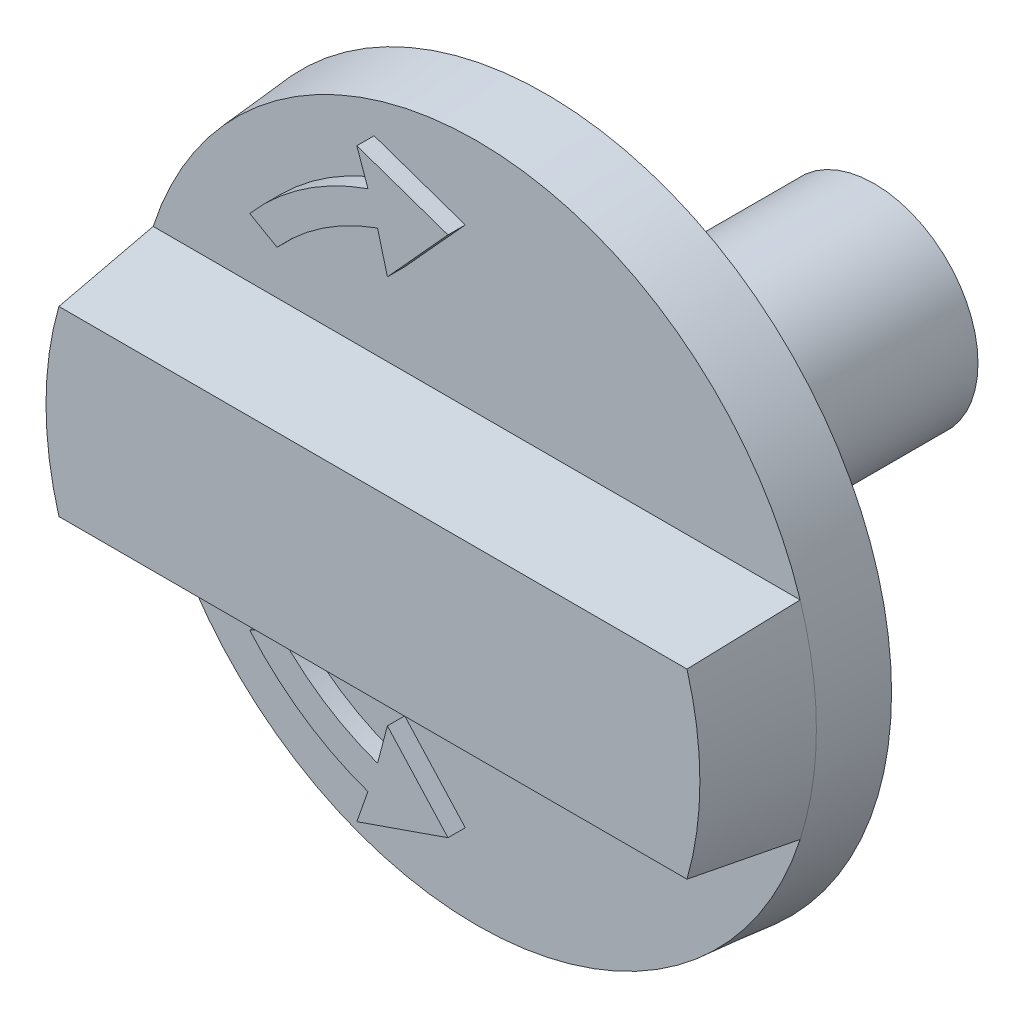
ISO-10303-21;
HEADER;
FILE_DESCRIPTION(('STEP AP214'),'2;1');
FILE_NAME('part.step','',(''),(''),'','','');
FILE_SCHEMA(('AUTOMOTIVE_DESIGN { 1 0 10303 214 1 1 1 1 }'));
ENDSEC;
DATA;
#1=APPLICATION_CONTEXT('core data for automotive mechanical design processes');
#2=APPLICATION_PROTOCOL_DEFINITION('international standard','automotive_design',2000,#1);
#3=PRODUCT_CONTEXT('',#1,'mechanical');
#4=PRODUCT('Part','Part','',(#3));
#5=PRODUCT_RELATED_PRODUCT_CATEGORY('part','',(#4));
#6=PRODUCT_DEFINITION_FORMATION('','',#4);
#7=PRODUCT_DEFINITION_CONTEXT('part definition',#1,'design');
#8=PRODUCT_DEFINITION('design','',#6,#7);
#9=PRODUCT_DEFINITION_SHAPE('','',#8);
#10=(LENGTH_UNIT() NAMED_UNIT(*) SI_UNIT(.MILLI.,.METRE.));
#11=(NAMED_UNIT(*) PLANE_ANGLE_UNIT() SI_UNIT($,.RADIAN.));
#12=(NAMED_UNIT(*) SI_UNIT($,.STERADIAN.) SOLID_ANGLE_UNIT());
#13=UNCERTAINTY_MEASURE_WITH_UNIT(LENGTH_MEASURE(1.E-05),#10,'distance_accuracy_value','');
#14=(GEOMETRIC_REPRESENTATION_CONTEXT(3) GLOBAL_UNCERTAINTY_ASSIGNED_CONTEXT((#13)) GLOBAL_UNIT_ASSIGNED_CONTEXT((#10,
#11,#12)) REPRESENTATION_CONTEXT('',''));
#15=CARTESIAN_POINT('',(0.,0.,0.));
#16=DIRECTION('',(0.,0.,1.));
#17=DIRECTION('',(1.,0.,0.));
#18=AXIS2_PLACEMENT_3D('',#15,#16,#17);
#19=CARTESIAN_POINT('',(0.,0.,0.));
#20=DIRECTION('',(0.,0.,1.));
#21=DIRECTION('',(1.,0.,0.));
#22=AXIS2_PLACEMENT_3D('',#19,#20,#21);
#23=PLANE('',#22);
#24=CARTESIAN_POINT('',(0.,0.,0.));
#25=DIRECTION('',(0.,0.,1.));
#26=DIRECTION('',(1.,0.,0.));
#27=AXIS2_PLACEMENT_3D('',#24,#25,#26);
#28=CIRCLE('',#27,10.);
#29=CARTESIAN_POINT('',(10.,0.,0.));
#30=VERTEX_POINT('',#29);
#31=EDGE_CURVE('E361',#30,#30,#28,.T.);
#32=ORIENTED_EDGE('',*,*,#31,.F.);
#33=EDGE_LOOP('',(#32));
#34=FACE_BOUND('',#33,.T.);
#35=CARTESIAN_POINT('',(0.,0.,0.));
#36=DIRECTION('',(0.,0.,1.));
#37=DIRECTION('',(1.,0.,0.));
#38=AXIS2_PLACEMENT_3D('',#35,#36,#37);
#39=CIRCLE('',#38,3.);
#40=CARTESIAN_POINT('',(3.,0.,0.));
#41=VERTEX_POINT('',#40);
#42=EDGE_CURVE('E11',#41,#41,#39,.F.);
#43=ORIENTED_EDGE('',*,*,#42,.F.);
#44=EDGE_LOOP('',(#43));
#45=FACE_BOUND('',#44,.T.);
#46=ADVANCED_FACE('F24',(#34,#45),#23,.F.);
#47=CARTESIAN_POINT('',(0.,0.,2.));
#48=DIRECTION('',(0.,0.,1.));
#49=DIRECTION('',(1.,0.,0.));
#50=AXIS2_PLACEMENT_3D('',#47,#48,#49);
#51=PLANE('',#50);
#52=DIRECTION('',(-1.,0.,0.));
#53=VECTOR('',#52,1.);
#54=CARTESIAN_POINT('',(-9.35580410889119,3.,2.));
#55=LINE('',#54,#53);
#56=CARTESIAN_POINT('',(9.35580410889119,3.,2.));
#57=VERTEX_POINT('',#56);
#58=CARTESIAN_POINT('',(-9.35580410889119,3.,2.));
#59=VERTEX_POINT('',#58);
#60=EDGE_CURVE('E308',#57,#59,#55,.T.);
#61=ORIENTED_EDGE('',*,*,#60,.F.);
#62=CARTESIAN_POINT('',(0.,0.,2.));
#63=DIRECTION('',(0.,0.,1.));
#64=DIRECTION('',(1.,0.,0.));
#65=AXIS2_PLACEMENT_3D('',#62,#63,#64);
#66=CIRCLE('',#65,9.82502267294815);
#67=EDGE_CURVE('E32',#57,#59,#66,.T.);
#68=ORIENTED_EDGE('',*,*,#67,.T.);
#69=EDGE_LOOP('',(#61,#68));
#70=FACE_BOUND('',#69,.T.);
#71=DIRECTION('',(0.867432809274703,-0.497554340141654,0.));
#72=VECTOR('',#71,1.);
#73=CARTESIAN_POINT('',(-6.06240197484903,5.2198929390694,2.));
#74=LINE('',#73,#72);
#75=CARTESIAN_POINT('',(-6.06240197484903,5.2198929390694,2.));
#76=VERTEX_POINT('',#75);
#77=CARTESIAN_POINT('',(-5.27297973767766,4.76708500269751,2.));
#78=VERTEX_POINT('',#77);
#79=EDGE_CURVE('E209',#76,#78,#74,.T.);
#80=ORIENTED_EDGE('',*,*,#79,.F.);
#81=CARTESIAN_POINT('',(0.,0.,2.));
#82=DIRECTION('',(0.,0.,1.));
#83=DIRECTION('',(-1.,0.,0.));
#84=AXIS2_PLACEMENT_3D('',#81,#82,#83);
#85=CIRCLE('',#84,8.);
#86=CARTESIAN_POINT('',(-2.64538356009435,7.54996329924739,2.));
#87=VERTEX_POINT('',#86);
#88=EDGE_CURVE('E206',#87,#76,#85,.T.);
#89=ORIENTED_EDGE('',*,*,#88,.F.);
#90=DIRECTION('',(0.330672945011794,-0.943745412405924,0.));
#91=VECTOR('',#90,1.);
#92=CARTESIAN_POINT('',(-2.64538356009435,7.54996329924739,2.));
#93=LINE('',#92,#91);
#94=CARTESIAN_POINT('',(-2.9662693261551,8.4657759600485,2.));
#95=VERTEX_POINT('',#94);
#96=EDGE_CURVE('E220',#95,#87,#93,.T.);
#97=ORIENTED_EDGE('',*,*,#96,.F.);
#98=DIRECTION('',(-0.944594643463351,0.328239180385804,0.));
#99=VECTOR('',#98,1.);
#100=CARTESIAN_POINT('',(-2.9662693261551,8.4657759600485,2.));
#101=LINE('',#100,#99);
#102=CARTESIAN_POINT('',(-0.330777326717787,7.54996329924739,2.));
#103=VERTEX_POINT('',#102);
#104=EDGE_CURVE('E217',#103,#95,#101,.T.);
#105=ORIENTED_EDGE('',*,*,#104,.F.);
#106=DIRECTION('',(0.672585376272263,0.740019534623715,0.));
#107=VECTOR('',#106,1.);
#108=CARTESIAN_POINT('',(-0.330777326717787,7.54996329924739,2.));
#109=LINE('',#108,#107);
#110=CARTESIAN_POINT('',(-2.08195140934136,5.62321455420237,2.));
#111=VERTEX_POINT('',#110);
#112=EDGE_CURVE('E215',#111,#103,#109,.T.);
#113=ORIENTED_EDGE('',*,*,#112,.F.);
#114=DIRECTION('',(0.255171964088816,-0.966895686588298,0.));
#115=VECTOR('',#114,1.);
#116=CARTESIAN_POINT('',(-2.08195140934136,5.62321455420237,2.));
#117=LINE('',#116,#115);
#118=CARTESIAN_POINT('',(-2.36686037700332,6.7027894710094,2.));
#119=VERTEX_POINT('',#118);
#120=EDGE_CURVE('E213',#119,#111,#117,.T.);
#121=ORIENTED_EDGE('',*,*,#120,.F.);
#122=CARTESIAN_POINT('',(0.,0.,2.));
#123=DIRECTION('',(0.,0.,-1.));
#124=DIRECTION('',(-1.,0.,0.));
#125=AXIS2_PLACEMENT_3D('',#122,#123,#124);
#126=CIRCLE('',#125,7.10840451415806);
#127=EDGE_CURVE('E211',#78,#119,#126,.T.);
#128=ORIENTED_EDGE('',*,*,#127,.F.);
#129=EDGE_LOOP('',(#80,#89,#97,#105,#113,#121,#128));
#130=FACE_BOUND('',#129,.T.);
#131=ADVANCED_FACE('F338',(#70,#130),#51,.T.);
#132=CARTESIAN_POINT('',(0.,0.,0.));
#133=DIRECTION('',(0.,0.,-1.));
#134=DIRECTION('',(1.,0.,0.));
#135=AXIS2_PLACEMENT_3D('',#132,#133,#134);
#136=CONICAL_SURFACE('',#135,10.,0.0872664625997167);
#137=ORIENTED_EDGE('',*,*,#67,.F.);
#138=CARTESIAN_POINT('',(0.,0.,2.));
#139=DIRECTION('',(0.,0.,1.));
#140=DIRECTION('',(1.,0.,0.));
#141=AXIS2_PLACEMENT_3D('',#138,#139,#140);
#142=CIRCLE('',#141,9.82502267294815);
#143=CARTESIAN_POINT('',(9.35580410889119,-3.,2.));
#144=VERTEX_POINT('',#143);
#145=EDGE_CURVE('E266',#144,#57,#142,.T.);
#146=ORIENTED_EDGE('',*,*,#145,.F.);
#147=CARTESIAN_POINT('',(-9.35580410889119,-3.,2.));
#148=VERTEX_POINT('',#147);
#149=EDGE_CURVE('E267',#148,#144,#66,.T.);
#150=ORIENTED_EDGE('',*,*,#149,.F.);
#151=CARTESIAN_POINT('',(0.,0.,2.));
#152=DIRECTION('',(0.,0.,1.));
#153=DIRECTION('',(1.,0.,0.));
#154=AXIS2_PLACEMENT_3D('',#151,#152,#153);
#155=CIRCLE('',#154,9.82502267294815);
#156=EDGE_CURVE('E256',#59,#148,#155,.T.);
#157=ORIENTED_EDGE('',*,*,#156,.F.);
#158=EDGE_LOOP('',(#137,#146,#150,#157));
#159=FACE_BOUND('',#158,.T.);
#160=ORIENTED_EDGE('',*,*,#31,.T.);
#161=EDGE_LOOP('',(#160));
#162=FACE_BOUND('',#161,.T.);
#163=ADVANCED_FACE('F26',(#159,#162),#136,.T.);
#164=CARTESIAN_POINT('',(0.,0.,2.));
#165=DIRECTION('',(0.,0.,-1.));
#166=DIRECTION('',(-1.,0.,0.));
#167=AXIS2_PLACEMENT_3D('',#164,#165,#166);
#168=CIRCLE('',#167,8.);
#169=CARTESIAN_POINT('',(-2.64538356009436,-7.54996329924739,2.));
#170=VERTEX_POINT('',#169);
#171=CARTESIAN_POINT('',(-6.06240197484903,-5.2198929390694,2.));
#172=VERTEX_POINT('',#171);
#173=EDGE_CURVE('E146',#170,#172,#168,.T.);
#174=ORIENTED_EDGE('',*,*,#173,.T.);
#175=DIRECTION('',(0.867432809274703,0.497554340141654,0.));
#176=VECTOR('',#175,1.);
#177=CARTESIAN_POINT('',(-6.06240197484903,-5.2198929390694,2.));
#178=LINE('',#177,#176);
#179=CARTESIAN_POINT('',(-5.27297973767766,-4.76708500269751,2.));
#180=VERTEX_POINT('',#179);
#181=EDGE_CURVE('E151',#172,#180,#178,.T.);
#182=ORIENTED_EDGE('',*,*,#181,.T.);
#183=CARTESIAN_POINT('',(0.,0.,2.));
#184=DIRECTION('',(0.,0.,1.));
#185=DIRECTION('',(-1.,0.,0.));
#186=AXIS2_PLACEMENT_3D('',#183,#184,#185);
#187=CIRCLE('',#186,7.10840451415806);
#188=CARTESIAN_POINT('',(-2.36686037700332,-6.7027894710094,2.));
#189=VERTEX_POINT('',#188);
#190=EDGE_CURVE('E169',#180,#189,#187,.T.);
#191=ORIENTED_EDGE('',*,*,#190,.T.);
#192=DIRECTION('',(0.255171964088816,0.966895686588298,0.));
#193=VECTOR('',#192,1.);
#194=CARTESIAN_POINT('',(-2.08195140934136,-5.62321455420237,2.));
#195=LINE('',#194,#193);
#196=CARTESIAN_POINT('',(-2.08195140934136,-5.62321455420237,2.));
#197=VERTEX_POINT('',#196);
#198=EDGE_CURVE('E173',#189,#197,#195,.T.);
#199=ORIENTED_EDGE('',*,*,#198,.T.);
#200=DIRECTION('',(0.672585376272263,-0.740019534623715,0.));
#201=VECTOR('',#200,1.);
#202=CARTESIAN_POINT('',(-0.330777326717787,-7.54996329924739,2.));
#203=LINE('',#202,#201);
#204=CARTESIAN_POINT('',(-0.330777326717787,-7.54996329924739,2.));
#205=VERTEX_POINT('',#204);
#206=EDGE_CURVE('E601',#197,#205,#203,.T.);
#207=ORIENTED_EDGE('',*,*,#206,.T.);
#208=DIRECTION('',(-0.944594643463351,-0.328239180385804,0.));
#209=VECTOR('',#208,1.);
#210=CARTESIAN_POINT('',(-2.9662693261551,-8.4657759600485,2.));
#211=LINE('',#210,#209);
#212=CARTESIAN_POINT('',(-2.9662693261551,-8.4657759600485,2.));
#213=VERTEX_POINT('',#212);
#214=EDGE_CURVE('E44',#205,#213,#211,.T.);
#215=ORIENTED_EDGE('',*,*,#214,.T.);
#216=DIRECTION('',(0.330672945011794,0.943745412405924,0.));
#217=VECTOR('',#216,1.);
#218=CARTESIAN_POINT('',(-2.64538356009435,-7.54996329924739,2.));
#219=LINE('',#218,#217);
#220=EDGE_CURVE('E39',#213,#170,#219,.T.);
#221=ORIENTED_EDGE('',*,*,#220,.T.);
#222=EDGE_LOOP('',(#174,#182,#191,#199,#207,#215,#221));
#223=FACE_BOUND('',#222,.T.);
#224=DIRECTION('',(1.,0.,0.));
#225=VECTOR('',#224,1.);
#226=CARTESIAN_POINT('',(-9.35580410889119,-3.,2.));
#227=LINE('',#226,#225);
#228=EDGE_CURVE('E262',#148,#144,#227,.T.);
#229=ORIENTED_EDGE('',*,*,#228,.F.);
#230=ORIENTED_EDGE('',*,*,#149,.T.);
#231=EDGE_LOOP('',(#229,#230));
#232=FACE_BOUND('',#231,.T.);
#233=ADVANCED_FACE('F148',(#223,#232),#51,.T.);
#234=CARTESIAN_POINT('',(0.,0.,2.));
#235=DIRECTION('',(0.,0.,-1.));
#236=DIRECTION('',(1.,0.,0.));
#237=AXIS2_PLACEMENT_3D('',#234,#235,#236);
#238=CONICAL_SURFACE('',#237,9.82502267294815,0.122173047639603);
#239=ORIENTED_EDGE('',*,*,#156,.T.);
#240=CARTESIAN_POINT('',(-9.08311763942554,-2.63164631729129,5.));
#241=CARTESIAN_POINT('',(-9.12923203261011,-2.69303126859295,4.50005969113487));
#242=CARTESIAN_POINT('',(-9.17501310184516,-2.75441988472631,4.00008953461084));
#243=CARTESIAN_POINT('',(-9.26590859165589,-2.87720444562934,3.00008953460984));
#244=CARTESIAN_POINT('',(-9.31102301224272,-2.93860039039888,2.50005969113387));
#245=CARTESIAN_POINT('',(-9.35580410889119,-3.,2.));
#246=B_SPLINE_CURVE_WITH_KNOTS('',3,(#240,#241,#242,#243,#244,#245),.UNSPECIFIED.,.F.,.F.,(4,2,
4),(0.,1.51740292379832,3.03480582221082),.UNSPECIFIED.);
#247=CARTESIAN_POINT('',(-9.08311763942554,-2.63164631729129,5.));
#248=VERTEX_POINT('',#247);
#249=EDGE_CURVE('E272',#248,#148,#246,.T.);
#250=ORIENTED_EDGE('',*,*,#249,.F.);
#251=CARTESIAN_POINT('',(0.,0.,5.));
#252=DIRECTION('',(0.,0.,1.));
#253=DIRECTION('',(1.,0.,0.));
#254=AXIS2_PLACEMENT_3D('',#251,#252,#253);
#255=CIRCLE('',#254,9.45666899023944);
#256=CARTESIAN_POINT('',(-9.08311763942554,2.63164631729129,5.));
#257=VERTEX_POINT('',#256);
#258=EDGE_CURVE('E311',#257,#248,#255,.T.);
#259=ORIENTED_EDGE('',*,*,#258,.F.);
#260=CARTESIAN_POINT('',(-9.08311763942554,2.63164631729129,5.));
#261=CARTESIAN_POINT('',(-9.12923203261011,2.69303126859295,4.50005969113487));
#262=CARTESIAN_POINT('',(-9.17501310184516,2.75441988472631,4.00008953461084));
#263=CARTESIAN_POINT('',(-9.26590859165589,2.87720444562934,3.00008953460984));
#264=CARTESIAN_POINT('',(-9.31102301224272,2.93860039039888,2.50005969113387));
#265=CARTESIAN_POINT('',(-9.35580410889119,3.,2.));
#266=B_SPLINE_CURVE_WITH_KNOTS('',3,(#260,#261,#262,#263,#264,#265),.UNSPECIFIED.,.F.,.F.,(4,2,
4),(0.,1.51740292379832,3.03480582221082),.UNSPECIFIED.);
#267=EDGE_CURVE('E312',#257,#59,#266,.T.);
#268=ORIENTED_EDGE('',*,*,#267,.T.);
#269=EDGE_LOOP('',(#239,#250,#259,#268));
#270=FACE_BOUND('',#269,.T.);
#271=ADVANCED_FACE('F291',(#270),#238,.T.);
#272=CARTESIAN_POINT('',(-9.35580410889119,-3.,2.));
#273=DIRECTION('',(0.,-0.992546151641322,0.121869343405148));
#274=DIRECTION('',(0.,-0.121869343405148,-0.992546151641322));
#275=AXIS2_PLACEMENT_3D('',#272,#273,#274);
#276=PLANE('',#275);
#277=ORIENTED_EDGE('',*,*,#228,.T.);
#278=CARTESIAN_POINT('',(9.08311763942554,-2.63164631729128,5.));
#279=CARTESIAN_POINT('',(9.12923203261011,-2.69303126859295,4.50005969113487));
#280=CARTESIAN_POINT('',(9.17501310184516,-2.75441988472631,4.00008953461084));
#281=CARTESIAN_POINT('',(9.26590859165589,-2.87720444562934,3.00008953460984));
#282=CARTESIAN_POINT('',(9.31102301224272,-2.93860039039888,2.50005969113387));
#283=CARTESIAN_POINT('',(9.35580410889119,-3.,2.));
#284=B_SPLINE_CURVE_WITH_KNOTS('',3,(#278,#279,#280,#281,#282,#283),.UNSPECIFIED.,.F.,.F.,(4,2,
4),(0.,1.51740292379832,3.03480582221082),.UNSPECIFIED.);
#285=CARTESIAN_POINT('',(9.08311763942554,-2.63164631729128,5.));
#286=VERTEX_POINT('',#285);
#287=EDGE_CURVE('E269',#286,#144,#284,.T.);
#288=ORIENTED_EDGE('',*,*,#287,.F.);
#289=DIRECTION('',(-1.,0.,0.));
#290=VECTOR('',#289,1.);
#291=CARTESIAN_POINT('',(-9.35580410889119,-2.63164631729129,5.));
#292=LINE('',#291,#290);
#293=EDGE_CURVE('E377',#248,#286,#292,.F.);
#294=ORIENTED_EDGE('',*,*,#293,.F.);
#295=ORIENTED_EDGE('',*,*,#249,.T.);
#296=EDGE_LOOP('',(#277,#288,#294,#295));
#297=FACE_BOUND('',#296,.T.);
#298=ADVANCED_FACE('F286',(#297),#276,.T.);
#299=CARTESIAN_POINT('',(0.,0.,2.));
#300=DIRECTION('',(0.,0.,-1.));
#301=DIRECTION('',(1.,0.,0.));
#302=AXIS2_PLACEMENT_3D('',#299,#300,#301);
#303=CONICAL_SURFACE('',#302,9.82502267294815,0.122173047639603);
#304=ORIENTED_EDGE('',*,*,#145,.T.);
#305=CARTESIAN_POINT('',(9.08311763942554,2.63164631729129,5.));
#306=CARTESIAN_POINT('',(9.12923203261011,2.69303126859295,4.50005969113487));
#307=CARTESIAN_POINT('',(9.17501310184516,2.75441988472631,4.00008953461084));
#308=CARTESIAN_POINT('',(9.26590859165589,2.87720444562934,3.00008953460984));
#309=CARTESIAN_POINT('',(9.31102301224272,2.93860039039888,2.50005969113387));
#310=CARTESIAN_POINT('',(9.35580410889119,3.,2.));
#311=B_SPLINE_CURVE_WITH_KNOTS('',3,(#305,#306,#307,#308,#309,#310),.UNSPECIFIED.,.F.,.F.,(4,2,
4),(0.,1.51740292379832,3.03480582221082),.UNSPECIFIED.);
#312=CARTESIAN_POINT('',(9.08311763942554,2.63164631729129,5.));
#313=VERTEX_POINT('',#312);
#314=EDGE_CURVE('E273',#313,#57,#311,.T.);
#315=ORIENTED_EDGE('',*,*,#314,.F.);
#316=CARTESIAN_POINT('',(0.,0.,5.));
#317=DIRECTION('',(0.,0.,1.));
#318=DIRECTION('',(1.,0.,0.));
#319=AXIS2_PLACEMENT_3D('',#316,#317,#318);
#320=CIRCLE('',#319,9.45666899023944);
#321=EDGE_CURVE('E378',#286,#313,#320,.T.);
#322=ORIENTED_EDGE('',*,*,#321,.F.);
#323=ORIENTED_EDGE('',*,*,#287,.T.);
#324=EDGE_LOOP('',(#304,#315,#322,#323));
#325=FACE_BOUND('',#324,.T.);
#326=ADVANCED_FACE('F282',(#325),#303,.T.);
#327=CARTESIAN_POINT('',(-9.35580410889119,3.,2.));
#328=DIRECTION('',(0.,0.992546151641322,0.121869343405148));
#329=DIRECTION('',(0.,-0.121869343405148,0.992546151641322));
#330=AXIS2_PLACEMENT_3D('',#327,#328,#329);
#331=PLANE('',#330);
#332=ORIENTED_EDGE('',*,*,#60,.T.);
#333=ORIENTED_EDGE('',*,*,#267,.F.);
#334=DIRECTION('',(1.,0.,0.));
#335=VECTOR('',#334,1.);
#336=CARTESIAN_POINT('',(-9.35580410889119,2.63164631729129,5.));
#337=LINE('',#336,#335);
#338=EDGE_CURVE('E315',#313,#257,#337,.F.);
#339=ORIENTED_EDGE('',*,*,#338,.F.);
#340=ORIENTED_EDGE('',*,*,#314,.T.);
#341=EDGE_LOOP('',(#332,#333,#339,#340));
#342=FACE_BOUND('',#341,.T.);
#343=ADVANCED_FACE('F321',(#342),#331,.T.);
#344=CARTESIAN_POINT('',(0.,0.,5.));
#345=DIRECTION('',(0.,0.,1.));
#346=DIRECTION('',(1.,0.,0.));
#347=AXIS2_PLACEMENT_3D('',#344,#345,#346);
#348=PLANE('',#347);
#349=ORIENTED_EDGE('',*,*,#258,.T.);
#350=ORIENTED_EDGE('',*,*,#293,.T.);
#351=ORIENTED_EDGE('',*,*,#321,.T.);
#352=ORIENTED_EDGE('',*,*,#338,.T.);
#353=EDGE_LOOP('',(#349,#350,#351,#352));
#354=FACE_BOUND('',#353,.T.);
#355=ADVANCED_FACE('F293',(#354),#348,.T.);
#356=CARTESIAN_POINT('',(0.,0.,2.5));
#357=DIRECTION('',(0.,0.,-1.));
#358=DIRECTION('',(-1.,0.,0.));
#359=AXIS2_PLACEMENT_3D('',#356,#357,#358);
#360=CYLINDRICAL_SURFACE('',#359,8.);
#361=ORIENTED_EDGE('',*,*,#88,.T.);
#362=DIRECTION('',(0.,0.,-1.));
#363=VECTOR('',#362,1.);
#364=CARTESIAN_POINT('',(-6.06240197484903,5.2198929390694,2.5));
#365=LINE('',#364,#363);
#366=CARTESIAN_POINT('',(-6.06240197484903,5.2198929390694,2.5));
#367=VERTEX_POINT('',#366);
#368=EDGE_CURVE('E254',#367,#76,#365,.T.);
#369=ORIENTED_EDGE('',*,*,#368,.F.);
#370=CARTESIAN_POINT('',(0.,0.,2.5));
#371=DIRECTION('',(0.,0.,1.));
#372=DIRECTION('',(-1.,0.,0.));
#373=AXIS2_PLACEMENT_3D('',#370,#371,#372);
#374=CIRCLE('',#373,8.);
#375=CARTESIAN_POINT('',(-2.64538356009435,7.54996329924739,2.5));
#376=VERTEX_POINT('',#375);
#377=EDGE_CURVE('E222',#376,#367,#374,.T.);
#378=ORIENTED_EDGE('',*,*,#377,.F.);
#379=DIRECTION('',(0.,0.,-1.));
#380=VECTOR('',#379,1.);
#381=CARTESIAN_POINT('',(-2.64538356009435,7.54996329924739,2.5));
#382=LINE('',#381,#380);
#383=EDGE_CURVE('E237',#376,#87,#382,.T.);
#384=ORIENTED_EDGE('',*,*,#383,.T.);
#385=EDGE_LOOP('',(#361,#369,#378,#384));
#386=FACE_BOUND('',#385,.T.);
#387=ADVANCED_FACE('F334',(#386),#360,.T.);
#388=CARTESIAN_POINT('',(-6.06240197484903,5.2198929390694,2.5));
#389=DIRECTION('',(0.497554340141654,0.867432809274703,0.));
#390=DIRECTION('',(-0.867432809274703,0.497554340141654,0.));
#391=AXIS2_PLACEMENT_3D('',#388,#389,#390);
#392=PLANE('',#391);
#393=ORIENTED_EDGE('',*,*,#79,.T.);
#394=DIRECTION('',(0.,0.,-1.));
#395=VECTOR('',#394,1.);
#396=CARTESIAN_POINT('',(-5.27297973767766,4.76708500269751,2.5));
#397=LINE('',#396,#395);
#398=CARTESIAN_POINT('',(-5.27297973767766,4.76708500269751,2.5));
#399=VERTEX_POINT('',#398);
#400=EDGE_CURVE('E251',#399,#78,#397,.T.);
#401=ORIENTED_EDGE('',*,*,#400,.F.);
#402=DIRECTION('',(0.867432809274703,-0.497554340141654,0.));
#403=VECTOR('',#402,1.);
#404=CARTESIAN_POINT('',(-6.06240197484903,5.2198929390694,2.5));
#405=LINE('',#404,#403);
#406=EDGE_CURVE('E225',#367,#399,#405,.T.);
#407=ORIENTED_EDGE('',*,*,#406,.F.);
#408=ORIENTED_EDGE('',*,*,#368,.T.);
#409=EDGE_LOOP('',(#393,#401,#407,#408));
#410=FACE_BOUND('',#409,.T.);
#411=ADVANCED_FACE('F390',(#410),#392,.F.);
#412=CARTESIAN_POINT('',(0.,0.,2.5));
#413=DIRECTION('',(0.,0.,-1.));
#414=DIRECTION('',(-1.,0.,0.));
#415=AXIS2_PLACEMENT_3D('',#412,#413,#414);
#416=CYLINDRICAL_SURFACE('',#415,7.10840451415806);
#417=ORIENTED_EDGE('',*,*,#127,.T.);
#418=DIRECTION('',(0.,0.,-1.));
#419=VECTOR('',#418,1.);
#420=CARTESIAN_POINT('',(-2.36686037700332,6.7027894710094,2.5));
#421=LINE('',#420,#419);
#422=CARTESIAN_POINT('',(-2.36686037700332,6.7027894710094,2.5));
#423=VERTEX_POINT('',#422);
#424=EDGE_CURVE('E248',#423,#119,#421,.T.);
#425=ORIENTED_EDGE('',*,*,#424,.F.);
#426=CARTESIAN_POINT('',(0.,0.,2.5));
#427=DIRECTION('',(0.,0.,-1.));
#428=DIRECTION('',(-1.,0.,0.));
#429=AXIS2_PLACEMENT_3D('',#426,#427,#428);
#430=CIRCLE('',#429,7.10840451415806);
#431=EDGE_CURVE('E227',#399,#423,#430,.T.);
#432=ORIENTED_EDGE('',*,*,#431,.F.);
#433=ORIENTED_EDGE('',*,*,#400,.T.);
#434=EDGE_LOOP('',(#417,#425,#432,#433));
#435=FACE_BOUND('',#434,.T.);
#436=ADVANCED_FACE('F394',(#435),#416,.F.);
#437=CARTESIAN_POINT('',(-2.08195140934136,5.62321455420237,2.5));
#438=DIRECTION('',(0.966895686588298,0.255171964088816,0.));
#439=DIRECTION('',(-0.255171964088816,0.966895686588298,0.));
#440=AXIS2_PLACEMENT_3D('',#437,#438,#439);
#441=PLANE('',#440);
#442=ORIENTED_EDGE('',*,*,#120,.T.);
#443=DIRECTION('',(0.,0.,-1.));
#444=VECTOR('',#443,1.);
#445=CARTESIAN_POINT('',(-2.08195140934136,5.62321455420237,2.5));
#446=LINE('',#445,#444);
#447=CARTESIAN_POINT('',(-2.08195140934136,5.62321455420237,2.5));
#448=VERTEX_POINT('',#447);
#449=EDGE_CURVE('E245',#448,#111,#446,.T.);
#450=ORIENTED_EDGE('',*,*,#449,.F.);
#451=DIRECTION('',(0.255171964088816,-0.966895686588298,0.));
#452=VECTOR('',#451,1.);
#453=CARTESIAN_POINT('',(-2.08195140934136,5.62321455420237,2.5));
#454=LINE('',#453,#452);
#455=EDGE_CURVE('E229',#423,#448,#454,.T.);
#456=ORIENTED_EDGE('',*,*,#455,.F.);
#457=ORIENTED_EDGE('',*,*,#424,.T.);
#458=EDGE_LOOP('',(#442,#450,#456,#457));
#459=FACE_BOUND('',#458,.T.);
#460=ADVANCED_FACE('F417',(#459),#441,.F.);
#461=CARTESIAN_POINT('',(-0.330777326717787,7.54996329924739,2.5));
#462=DIRECTION('',(-0.740019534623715,0.672585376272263,0.));
#463=DIRECTION('',(-0.672585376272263,-0.740019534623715,0.));
#464=AXIS2_PLACEMENT_3D('',#461,#462,#463);
#465=PLANE('',#464);
#466=ORIENTED_EDGE('',*,*,#112,.T.);
#467=DIRECTION('',(0.,0.,-1.));
#468=VECTOR('',#467,1.);
#469=CARTESIAN_POINT('',(-0.330777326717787,7.54996329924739,2.5));
#470=LINE('',#469,#468);
#471=CARTESIAN_POINT('',(-0.330777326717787,7.54996329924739,2.5));
#472=VERTEX_POINT('',#471);
#473=EDGE_CURVE('E242',#472,#103,#470,.T.);
#474=ORIENTED_EDGE('',*,*,#473,.F.);
#475=DIRECTION('',(0.672585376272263,0.740019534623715,0.));
#476=VECTOR('',#475,1.);
#477=CARTESIAN_POINT('',(-0.330777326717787,7.54996329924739,2.5));
#478=LINE('',#477,#476);
#479=EDGE_CURVE('E231',#448,#472,#478,.T.);
#480=ORIENTED_EDGE('',*,*,#479,.F.);
#481=ORIENTED_EDGE('',*,*,#449,.T.);
#482=EDGE_LOOP('',(#466,#474,#480,#481));
#483=FACE_BOUND('',#482,.T.);
#484=ADVANCED_FACE('F415',(#483),#465,.F.);
#485=CARTESIAN_POINT('',(-2.9662693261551,8.4657759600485,2.5));
#486=DIRECTION('',(-0.328239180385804,-0.944594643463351,0.));
#487=DIRECTION('',(0.944594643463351,-0.328239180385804,0.));
#488=AXIS2_PLACEMENT_3D('',#485,#486,#487);
#489=PLANE('',#488);
#490=ORIENTED_EDGE('',*,*,#104,.T.);
#491=DIRECTION('',(0.,0.,-1.));
#492=VECTOR('',#491,1.);
#493=CARTESIAN_POINT('',(-2.9662693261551,8.4657759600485,2.5));
#494=LINE('',#493,#492);
#495=CARTESIAN_POINT('',(-2.9662693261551,8.4657759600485,2.5));
#496=VERTEX_POINT('',#495);
#497=EDGE_CURVE('E240',#496,#95,#494,.T.);
#498=ORIENTED_EDGE('',*,*,#497,.F.);
#499=DIRECTION('',(-0.944594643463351,0.328239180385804,0.));
#500=VECTOR('',#499,1.);
#501=CARTESIAN_POINT('',(-2.9662693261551,8.4657759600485,2.5));
#502=LINE('',#501,#500);
#503=EDGE_CURVE('E233',#472,#496,#502,.T.);
#504=ORIENTED_EDGE('',*,*,#503,.F.);
#505=ORIENTED_EDGE('',*,*,#473,.T.);
#506=EDGE_LOOP('',(#490,#498,#504,#505));
#507=FACE_BOUND('',#506,.T.);
#508=ADVANCED_FACE('F410',(#507),#489,.F.);
#509=CARTESIAN_POINT('',(-2.64538356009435,7.54996329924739,2.5));
#510=DIRECTION('',(0.943745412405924,0.330672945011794,0.));
#511=DIRECTION('',(-0.330672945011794,0.943745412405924,0.));
#512=AXIS2_PLACEMENT_3D('',#509,#510,#511);
#513=PLANE('',#512);
#514=ORIENTED_EDGE('',*,*,#96,.T.);
#515=ORIENTED_EDGE('',*,*,#383,.F.);
#516=DIRECTION('',(0.330672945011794,-0.943745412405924,0.));
#517=VECTOR('',#516,1.);
#518=CARTESIAN_POINT('',(-2.64538356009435,7.54996329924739,2.5));
#519=LINE('',#518,#517);
#520=EDGE_CURVE('E235',#496,#376,#519,.T.);
#521=ORIENTED_EDGE('',*,*,#520,.F.);
#522=ORIENTED_EDGE('',*,*,#497,.T.);
#523=EDGE_LOOP('',(#514,#515,#521,#522));
#524=FACE_BOUND('',#523,.T.);
#525=ADVANCED_FACE('F405',(#524),#513,.F.);
#526=CARTESIAN_POINT('',(0.,0.,2.5));
#527=DIRECTION('',(0.,0.,-1.));
#528=DIRECTION('',(-1.,0.,0.));
#529=AXIS2_PLACEMENT_3D('',#526,#527,#528);
#530=PLANE('',#529);
#531=ORIENTED_EDGE('',*,*,#377,.T.);
#532=ORIENTED_EDGE('',*,*,#406,.T.);
#533=ORIENTED_EDGE('',*,*,#431,.T.);
#534=ORIENTED_EDGE('',*,*,#455,.T.);
#535=ORIENTED_EDGE('',*,*,#479,.T.);
#536=ORIENTED_EDGE('',*,*,#503,.T.);
#537=ORIENTED_EDGE('',*,*,#520,.T.);
#538=EDGE_LOOP('',(#531,#532,#533,#534,#535,#536,#537));
#539=FACE_BOUND('',#538,.T.);
#540=ADVANCED_FACE('F398',(#539),#530,.F.);
#541=CARTESIAN_POINT('',(0.,0.,2.5));
#542=DIRECTION('',(0.,0.,-1.));
#543=DIRECTION('',(-1.,0.,0.));
#544=AXIS2_PLACEMENT_3D('',#541,#542,#543);
#545=CYLINDRICAL_SURFACE('',#544,8.);
#546=ORIENTED_EDGE('',*,*,#173,.F.);
#547=DIRECTION('',(0.,0.,-1.));
#548=VECTOR('',#547,1.);
#549=CARTESIAN_POINT('',(-2.64538356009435,-7.54996329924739,2.5));
#550=LINE('',#549,#548);
#551=CARTESIAN_POINT('',(-2.64538356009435,-7.54996329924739,2.5));
#552=VERTEX_POINT('',#551);
#553=EDGE_CURVE('E204',#552,#170,#550,.T.);
#554=ORIENTED_EDGE('',*,*,#553,.F.);
#555=CARTESIAN_POINT('',(0.,0.,2.5));
#556=DIRECTION('',(0.,0.,-1.));
#557=DIRECTION('',(-1.,0.,0.));
#558=AXIS2_PLACEMENT_3D('',#555,#556,#557);
#559=CIRCLE('',#558,8.);
#560=CARTESIAN_POINT('',(-6.06240197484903,-5.2198929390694,2.5));
#561=VERTEX_POINT('',#560);
#562=EDGE_CURVE('E160',#552,#561,#559,.T.);
#563=ORIENTED_EDGE('',*,*,#562,.T.);
#564=DIRECTION('',(0.,0.,-1.));
#565=VECTOR('',#564,1.);
#566=CARTESIAN_POINT('',(-6.06240197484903,-5.2198929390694,2.5));
#567=LINE('',#566,#565);
#568=EDGE_CURVE('E157',#561,#172,#567,.T.);
#569=ORIENTED_EDGE('',*,*,#568,.T.);
#570=EDGE_LOOP('',(#546,#554,#563,#569));
#571=FACE_BOUND('',#570,.T.);
#572=ADVANCED_FACE('F158',(#571),#545,.T.);
#573=CARTESIAN_POINT('',(-2.64538356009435,-7.54996329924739,2.5));
#574=DIRECTION('',(-0.943745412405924,0.330672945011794,0.));
#575=DIRECTION('',(-0.330672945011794,-0.943745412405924,0.));
#576=AXIS2_PLACEMENT_3D('',#573,#574,#575);
#577=PLANE('',#576);
#578=ORIENTED_EDGE('',*,*,#220,.F.);
#579=DIRECTION('',(0.,0.,-1.));
#580=VECTOR('',#579,1.);
#581=CARTESIAN_POINT('',(-2.9662693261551,-8.4657759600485,2.5));
#582=LINE('',#581,#580);
#583=CARTESIAN_POINT('',(-2.9662693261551,-8.4657759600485,2.5));
#584=VERTEX_POINT('',#583);
#585=EDGE_CURVE('E202',#584,#213,#582,.T.);
#586=ORIENTED_EDGE('',*,*,#585,.F.);
#587=DIRECTION('',(0.330672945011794,0.943745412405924,0.));
#588=VECTOR('',#587,1.);
#589=CARTESIAN_POINT('',(-2.64538356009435,-7.54996329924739,2.5));
#590=LINE('',#589,#588);
#591=EDGE_CURVE('E171',#584,#552,#590,.T.);
#592=ORIENTED_EDGE('',*,*,#591,.T.);
#593=ORIENTED_EDGE('',*,*,#553,.T.);
#594=EDGE_LOOP('',(#578,#586,#592,#593));
#595=FACE_BOUND('',#594,.T.);
#596=ADVANCED_FACE('F497',(#595),#577,.T.);
#597=CARTESIAN_POINT('',(-2.9662693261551,-8.4657759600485,2.5));
#598=DIRECTION('',(0.328239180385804,-0.944594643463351,0.));
#599=DIRECTION('',(0.944594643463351,0.328239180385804,0.));
#600=AXIS2_PLACEMENT_3D('',#597,#598,#599);
#601=PLANE('',#600);
#602=ORIENTED_EDGE('',*,*,#214,.F.);
#603=DIRECTION('',(0.,0.,-1.));
#604=VECTOR('',#603,1.);
#605=CARTESIAN_POINT('',(-0.330777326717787,-7.54996329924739,2.5));
#606=LINE('',#605,#604);
#607=CARTESIAN_POINT('',(-0.330777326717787,-7.54996329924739,2.5));
#608=VERTEX_POINT('',#607);
#609=EDGE_CURVE('E199',#608,#205,#606,.T.);
#610=ORIENTED_EDGE('',*,*,#609,.F.);
#611=DIRECTION('',(-0.944594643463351,-0.328239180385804,0.));
#612=VECTOR('',#611,1.);
#613=CARTESIAN_POINT('',(-2.9662693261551,-8.4657759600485,2.5));
#614=LINE('',#613,#612);
#615=EDGE_CURVE('E179',#608,#584,#614,.T.);
#616=ORIENTED_EDGE('',*,*,#615,.T.);
#617=ORIENTED_EDGE('',*,*,#585,.T.);
#618=EDGE_LOOP('',(#602,#610,#616,#617));
#619=FACE_BOUND('',#618,.T.);
#620=ADVANCED_FACE('F504',(#619),#601,.T.);
#621=CARTESIAN_POINT('',(-0.330777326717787,-7.54996329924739,2.5));
#622=DIRECTION('',(0.740019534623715,0.672585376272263,0.));
#623=DIRECTION('',(-0.672585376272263,0.740019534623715,0.));
#624=AXIS2_PLACEMENT_3D('',#621,#622,#623);
#625=PLANE('',#624);
#626=ORIENTED_EDGE('',*,*,#206,.F.);
#627=DIRECTION('',(0.,0.,-1.));
#628=VECTOR('',#627,1.);
#629=CARTESIAN_POINT('',(-2.08195140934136,-5.62321455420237,2.5));
#630=LINE('',#629,#628);
#631=CARTESIAN_POINT('',(-2.08195140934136,-5.62321455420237,2.5));
#632=VERTEX_POINT('',#631);
#633=EDGE_CURVE('E196',#632,#197,#630,.T.);
#634=ORIENTED_EDGE('',*,*,#633,.F.);
#635=DIRECTION('',(0.672585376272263,-0.740019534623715,0.));
#636=VECTOR('',#635,1.);
#637=CARTESIAN_POINT('',(-0.330777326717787,-7.54996329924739,2.5));
#638=LINE('',#637,#636);
#639=EDGE_CURVE('E182',#632,#608,#638,.T.);
#640=ORIENTED_EDGE('',*,*,#639,.T.);
#641=ORIENTED_EDGE('',*,*,#609,.T.);
#642=EDGE_LOOP('',(#626,#634,#640,#641));
#643=FACE_BOUND('',#642,.T.);
#644=ADVANCED_FACE('F512',(#643),#625,.T.);
#645=CARTESIAN_POINT('',(-2.08195140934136,-5.62321455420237,2.5));
#646=DIRECTION('',(-0.966895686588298,0.255171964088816,0.));
#647=DIRECTION('',(-0.255171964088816,-0.966895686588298,0.));
#648=AXIS2_PLACEMENT_3D('',#645,#646,#647);
#649=PLANE('',#648);
#650=ORIENTED_EDGE('',*,*,#198,.F.);
#651=DIRECTION('',(0.,0.,-1.));
#652=VECTOR('',#651,1.);
#653=CARTESIAN_POINT('',(-2.36686037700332,-6.7027894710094,2.5));
#654=LINE('',#653,#652);
#655=CARTESIAN_POINT('',(-2.36686037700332,-6.7027894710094,2.5));
#656=VERTEX_POINT('',#655);
#657=EDGE_CURVE('E193',#656,#189,#654,.T.);
#658=ORIENTED_EDGE('',*,*,#657,.F.);
#659=DIRECTION('',(0.255171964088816,0.966895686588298,0.));
#660=VECTOR('',#659,1.);
#661=CARTESIAN_POINT('',(-2.08195140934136,-5.62321455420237,2.5));
#662=LINE('',#661,#660);
#663=EDGE_CURVE('E185',#656,#632,#662,.T.);
#664=ORIENTED_EDGE('',*,*,#663,.T.);
#665=ORIENTED_EDGE('',*,*,#633,.T.);
#666=EDGE_LOOP('',(#650,#658,#664,#665));
#667=FACE_BOUND('',#666,.T.);
#668=ADVANCED_FACE('F520',(#667),#649,.T.);
#669=CARTESIAN_POINT('',(0.,0.,2.5));
#670=DIRECTION('',(0.,0.,-1.));
#671=DIRECTION('',(-1.,0.,0.));
#672=AXIS2_PLACEMENT_3D('',#669,#670,#671);
#673=CYLINDRICAL_SURFACE('',#672,7.10840451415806);
#674=ORIENTED_EDGE('',*,*,#190,.F.);
#675=DIRECTION('',(0.,0.,-1.));
#676=VECTOR('',#675,1.);
#677=CARTESIAN_POINT('',(-5.27297973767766,-4.76708500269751,2.5));
#678=LINE('',#677,#676);
#679=CARTESIAN_POINT('',(-5.27297973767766,-4.76708500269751,2.5));
#680=VERTEX_POINT('',#679);
#681=EDGE_CURVE('E164',#680,#180,#678,.T.);
#682=ORIENTED_EDGE('',*,*,#681,.F.);
#683=CARTESIAN_POINT('',(0.,0.,2.5));
#684=DIRECTION('',(0.,0.,1.));
#685=DIRECTION('',(-1.,0.,0.));
#686=AXIS2_PLACEMENT_3D('',#683,#684,#685);
#687=CIRCLE('',#686,7.10840451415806);
#688=EDGE_CURVE('E188',#680,#656,#687,.T.);
#689=ORIENTED_EDGE('',*,*,#688,.T.);
#690=ORIENTED_EDGE('',*,*,#657,.T.);
#691=EDGE_LOOP('',(#674,#682,#689,#690));
#692=FACE_BOUND('',#691,.T.);
#693=ADVANCED_FACE('F528',(#692),#673,.F.);
#694=CARTESIAN_POINT('',(-6.06240197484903,-5.2198929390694,2.5));
#695=DIRECTION('',(-0.497554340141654,0.867432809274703,0.));
#696=DIRECTION('',(-0.867432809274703,-0.497554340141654,0.));
#697=AXIS2_PLACEMENT_3D('',#694,#695,#696);
#698=PLANE('',#697);
#699=ORIENTED_EDGE('',*,*,#181,.F.);
#700=ORIENTED_EDGE('',*,*,#568,.F.);
#701=DIRECTION('',(0.867432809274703,0.497554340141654,0.));
#702=VECTOR('',#701,1.);
#703=CARTESIAN_POINT('',(-6.06240197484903,-5.2198929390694,2.5));
#704=LINE('',#703,#702);
#705=EDGE_CURVE('E165',#561,#680,#704,.T.);
#706=ORIENTED_EDGE('',*,*,#705,.T.);
#707=ORIENTED_EDGE('',*,*,#681,.T.);
#708=EDGE_LOOP('',(#699,#700,#706,#707));
#709=FACE_BOUND('',#708,.T.);
#710=ADVANCED_FACE('F167',(#709),#698,.T.);
#711=CARTESIAN_POINT('',(0.,0.,2.5));
#712=DIRECTION('',(0.,0.,-1.));
#713=DIRECTION('',(-1.,0.,0.));
#714=AXIS2_PLACEMENT_3D('',#711,#712,#713);
#715=PLANE('',#714);
#716=ORIENTED_EDGE('',*,*,#562,.F.);
#717=ORIENTED_EDGE('',*,*,#591,.F.);
#718=ORIENTED_EDGE('',*,*,#615,.F.);
#719=ORIENTED_EDGE('',*,*,#639,.F.);
#720=ORIENTED_EDGE('',*,*,#663,.F.);
#721=ORIENTED_EDGE('',*,*,#688,.F.);
#722=ORIENTED_EDGE('',*,*,#705,.F.);
#723=EDGE_LOOP('',(#716,#717,#718,#719,#720,#721,#722));
#724=FACE_BOUND('',#723,.T.);
#725=ADVANCED_FACE('F543',(#724),#715,.F.);
#726=CARTESIAN_POINT('',(0.,0.,-9.5));
#727=DIRECTION('',(0.,0.,1.));
#728=DIRECTION('',(1.,0.,0.));
#729=AXIS2_PLACEMENT_3D('',#726,#727,#728);
#730=CYLINDRICAL_SURFACE('',#729,3.);
#731=CARTESIAN_POINT('',(0.,-3.,-4.5));
#732=CARTESIAN_POINT('',(-0.0788579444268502,-2.99999570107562,-4.50000495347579));
#733=CARTESIAN_POINT('',(-0.157809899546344,-2.99685736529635,-4.50625510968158));
#734=CARTESIAN_POINT('',(-0.313380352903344,-2.98461234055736,-4.53097932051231));
#735=CARTESIAN_POINT('',(-0.389994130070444,-2.97549431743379,-4.54947658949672));
#736=CARTESIAN_POINT('',(-0.538400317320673,-2.95224419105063,-4.59779071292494));
#737=CARTESIAN_POINT('',(-0.610210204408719,-2.93813158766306,-4.62756357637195));
#738=CARTESIAN_POINT('',(-0.747708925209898,-2.90618664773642,-4.69735593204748));
#739=CARTESIAN_POINT('',(-0.813398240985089,-2.88835460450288,-4.7373746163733));
#740=CARTESIAN_POINT('',(-0.941261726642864,-2.84934387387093,-4.82927587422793));
#741=CARTESIAN_POINT('',(-1.00298281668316,-2.82802798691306,-4.88172971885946));
#742=CARTESIAN_POINT('',(-1.11716916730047,-2.78489955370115,-4.99578221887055));
#743=CARTESIAN_POINT('',(-1.16962737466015,-2.76308664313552,-5.05738777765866));
#744=CARTESIAN_POINT('',(-1.26787800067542,-2.71948426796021,-5.19372502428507));
#745=CARTESIAN_POINT('',(-1.31283800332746,-2.69782780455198,-5.26910414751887));
#746=CARTESIAN_POINT('',(-1.38925234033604,-2.65928968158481,-5.42755100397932));
#747=CARTESIAN_POINT('',(-1.4207163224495,-2.64240461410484,-5.51061319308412));
#748=CARTESIAN_POINT('',(-1.46719866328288,-2.61686800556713,-5.67699765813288));
#749=CARTESIAN_POINT('',(-1.48308878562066,-2.6077840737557,-5.76000667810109));
#750=CARTESIAN_POINT('',(-1.50064048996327,-2.59772834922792,-5.92796825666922));
#751=CARTESIAN_POINT('',(-1.50231613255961,-2.59674854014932,-6.01291881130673));
#752=CARTESIAN_POINT('',(-1.49203093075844,-2.60266395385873,-6.17142903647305));
#753=CARTESIAN_POINT('',(-1.48167683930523,-2.6086314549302,-6.24513604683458));
#754=CARTESIAN_POINT('',(-1.4504097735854,-2.62614343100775,-6.38958286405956));
#755=CARTESIAN_POINT('',(-1.42949343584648,-2.63768968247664,-6.46032171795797));
#756=CARTESIAN_POINT('',(-1.37731467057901,-2.66531214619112,-6.59884369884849));
#757=CARTESIAN_POINT('',(-1.34582260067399,-2.68148760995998,-6.66651959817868));
#758=CARTESIAN_POINT('',(-1.273562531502,-2.71655106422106,-6.79595143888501));
#759=CARTESIAN_POINT('',(-1.2327903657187,-2.73544027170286,-6.85770470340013));
#760=CARTESIAN_POINT('',(-1.13709908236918,-2.77669736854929,-6.98178187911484));
#761=CARTESIAN_POINT('',(-1.08104168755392,-2.79920265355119,-7.04318531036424));
#762=CARTESIAN_POINT('',(-0.95933336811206,-2.84321434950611,-7.15610312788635));
#763=CARTESIAN_POINT('',(-0.893677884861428,-2.86472027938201,-7.20761278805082));
#764=CARTESIAN_POINT('',(-0.750774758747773,-2.90552980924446,-7.30152849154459));
#765=CARTESIAN_POINT('',(-0.673130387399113,-2.92468476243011,-7.34340070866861));
#766=CARTESIAN_POINT('',(-0.510699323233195,-2.95736821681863,-7.41314554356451));
#767=CARTESIAN_POINT('',(-0.425918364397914,-2.9709011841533,-7.44102927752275));
#768=CARTESIAN_POINT('',(-0.259149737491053,-2.98986500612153,-7.47971310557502));
#769=CARTESIAN_POINT('',(-0.177512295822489,-2.99587407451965,-7.49173685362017));
#770=CARTESIAN_POINT('',(-0.0131693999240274,-3.00109520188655,-7.50219709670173));
#771=CARTESIAN_POINT('',(0.0695355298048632,-3.00031048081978,-7.5006400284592));
#772=CARTESIAN_POINT('',(0.226849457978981,-2.99236788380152,-7.48468996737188));
#773=CARTESIAN_POINT('',(0.301589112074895,-2.98570868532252,-7.47130120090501));
#774=CARTESIAN_POINT('',(0.447610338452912,-2.9673325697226,-7.43364289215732));
#775=CARTESIAN_POINT('',(0.51889152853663,-2.95561509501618,-7.40937215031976));
#776=CARTESIAN_POINT('',(0.658332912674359,-2.92776377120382,-7.35000230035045));
#777=CARTESIAN_POINT('',(0.726345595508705,-2.91151322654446,-7.31461342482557));
#778=CARTESIAN_POINT('',(0.855692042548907,-2.87615961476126,-7.23433869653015));
#779=CARTESIAN_POINT('',(0.917022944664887,-2.85705533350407,-7.18944879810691));
#780=CARTESIAN_POINT('',(1.03765153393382,-2.81562332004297,-7.08635936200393));
#781=CARTESIAN_POINT('',(1.09615811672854,-2.79316327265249,-7.02728569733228));
#782=CARTESIAN_POINT('',(1.20278448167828,-2.7489358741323,-6.90011227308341));
#783=CARTESIAN_POINT('',(1.25089707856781,-2.72716901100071,-6.83200632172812));
#784=CARTESIAN_POINT('',(1.33756187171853,-2.68576788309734,-6.68453451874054));
#785=CARTESIAN_POINT('',(1.37553824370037,-2.66628794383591,-6.60478310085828));
#786=CARTESIAN_POINT('',(1.43712423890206,-2.63361108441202,-6.43873489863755));
#787=CARTESIAN_POINT('',(1.46075237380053,-2.62040607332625,-6.35244671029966));
#788=CARTESIAN_POINT('',(1.49079253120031,-2.60342251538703,-6.18463466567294));
#789=CARTESIAN_POINT('',(1.49863949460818,-2.59886075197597,-6.10344861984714));
#790=CARTESIAN_POINT('',(1.5010337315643,-2.59748031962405,-5.94082939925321));
#791=CARTESIAN_POINT('',(1.49558676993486,-2.60065829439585,-5.85939634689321));
#792=CARTESIAN_POINT('',(1.47288918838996,-2.61356793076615,-5.70677474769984));
#793=CARTESIAN_POINT('',(1.45681247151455,-2.62264641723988,-5.63534929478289));
#794=CARTESIAN_POINT('',(1.41476303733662,-2.64556524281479,-5.49628782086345));
#795=CARTESIAN_POINT('',(1.38878713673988,-2.65940711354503,-5.42865302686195));
#796=CARTESIAN_POINT('',(1.32572361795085,-2.69142795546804,-5.2940627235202));
#797=CARTESIAN_POINT('',(1.28800670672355,-2.70983583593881,-5.22745814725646));
#798=CARTESIAN_POINT('',(1.20322645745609,-2.74852997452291,-5.10108819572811));
#799=CARTESIAN_POINT('',(1.15615825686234,-2.76881720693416,-5.04132640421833));
#800=CARTESIAN_POINT('',(1.04730498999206,-2.81193484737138,-4.92278702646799));
#801=CARTESIAN_POINT('',(0.984426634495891,-2.83477474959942,-4.86501134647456));
#802=CARTESIAN_POINT('',(0.849232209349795,-2.87816628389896,-4.7606055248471));
#803=CARTESIAN_POINT('',(0.776911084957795,-2.89871667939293,-4.71398139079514));
#804=CARTESIAN_POINT('',(0.623897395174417,-2.93547014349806,-4.63314545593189));
#805=CARTESIAN_POINT('',(0.543149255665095,-2.95164144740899,-4.5990237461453));
#806=CARTESIAN_POINT('',(0.376113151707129,-2.9775201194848,-4.54528774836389));
#807=CARTESIAN_POINT('',(0.289841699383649,-2.98724585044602,-4.52563222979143));
#808=CARTESIAN_POINT('',(0.168902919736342,-2.99543192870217,-4.50915388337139));
#809=CARTESIAN_POINT('',(0.135242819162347,-2.99714048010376,-4.50572603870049));
#810=CARTESIAN_POINT('',(0.0677275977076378,-2.99942545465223,-4.50114800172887));
#811=CARTESIAN_POINT('',(0.0338724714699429,-3.00000184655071,-4.49999787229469));
#812=CARTESIAN_POINT('',(0.,-3.,-4.5));
#813=B_SPLINE_CURVE_WITH_KNOTS('',3,(#731,#732,#733,#734,#735,#736,#737,#738,#739,#740,#741,
#742,#743,#744,#745,#746,#747,#748,#749,#750,#751,#752,#753,#754,#755,#756,#757,#758,#759,#760,
#761,#762,#763,#764,#765,#766,#767,#768,#769,#770,#771,#772,#773,#774,#775,#776,#777,#778,#779,
#780,#781,#782,#783,#784,#785,#786,#787,#788,#789,#790,#791,#792,#793,#794,#795,#796,#797,#798,
#799,#800,#801,#802,#803,#804,#805,#806,#807,#808,#809,#810,#811,#812),.UNSPECIFIED.,.T.,.F.,(4,
2,2,2,2,2,2,2,2,2,2,2,2,2,2,2,2,2,2,2,2,2,2,2,2,2,2,2,2,2,2,2,2,2,2,2,2,2,2,2,4),(0.,
0.236436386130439,0.473322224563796,0.709293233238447,0.945245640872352,1.19547263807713,
1.44588935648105,1.71572589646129,1.98536921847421,2.23887018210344,2.49212035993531,
2.71508568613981,2.93812205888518,3.16635360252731,3.39468781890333,3.65197412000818,
3.9093830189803,4.17874533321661,4.44789325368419,4.69474935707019,4.94148846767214,
5.16910359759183,5.39674382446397,5.63089284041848,5.86514176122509,6.12239415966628,
6.37982382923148,6.64972023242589,6.91926767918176,7.1629396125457,7.40650589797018,
7.62686895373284,7.84730293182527,8.08254685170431,8.31791341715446,8.58187864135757,
8.84598575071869,9.1119602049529,9.37717362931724,9.47872920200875,9.58028757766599),.UNSPECIFIED.);
#814=CARTESIAN_POINT('',(0.,-3.,-4.5));
#815=VERTEX_POINT('',#814);
#816=EDGE_CURVE('E590',#815,#815,#813,.T.);
#817=ORIENTED_EDGE('',*,*,#816,.F.);
#818=EDGE_LOOP('',(#817));
#819=FACE_BOUND('',#818,.T.);
#820=CARTESIAN_POINT('',(0.,0.,-9.5));
#821=DIRECTION('',(0.,0.,-1.));
#822=DIRECTION('',(-1.,0.,0.));
#823=AXIS2_PLACEMENT_3D('',#820,#821,#822);
#824=CIRCLE('',#823,3.);
#825=CARTESIAN_POINT('',(-3.,0.,-9.5));
#826=VERTEX_POINT('',#825);
#827=EDGE_CURVE('E154',#826,#826,#824,.T.);
#828=ORIENTED_EDGE('',*,*,#827,.F.);
#829=EDGE_LOOP('',(#828));
#830=FACE_BOUND('',#829,.T.);
#831=ORIENTED_EDGE('',*,*,#42,.T.);
#832=EDGE_LOOP('',(#831));
#833=FACE_BOUND('',#832,.T.);
#834=ADVANCED_FACE('F550',(#819,#830,#833),#730,.T.);
#835=CARTESIAN_POINT('',(0.,0.,-9.5));
#836=DIRECTION('',(0.,0.,-1.));
#837=DIRECTION('',(-1.,0.,0.));
#838=AXIS2_PLACEMENT_3D('',#835,#836,#837);
#839=PLANE('',#838);
#840=ORIENTED_EDGE('',*,*,#827,.T.);
#841=EDGE_LOOP('',(#840));
#842=FACE_BOUND('',#841,.T.);
#843=ADVANCED_FACE('F558',(#842),#839,.T.);
#844=CARTESIAN_POINT('',(0.,-10.001,-6.));
#845=DIRECTION('',(0.,1.,0.));
#846=DIRECTION('',(0.,0.,1.));
#847=AXIS2_PLACEMENT_3D('',#844,#845,#846);
#848=CYLINDRICAL_SURFACE('',#847,1.5);
#849=ORIENTED_EDGE('',*,*,#816,.T.);
#850=EDGE_LOOP('',(#849));
#851=FACE_BOUND('',#850,.T.);
#852=CARTESIAN_POINT('',(0.,2.4,-6.));
#853=DIRECTION('',(0.,1.,0.));
#854=DIRECTION('',(0.,0.,1.));
#855=AXIS2_PLACEMENT_3D('',#852,#853,#854);
#856=CIRCLE('',#855,1.5);
#857=CARTESIAN_POINT('',(0.,2.4,-4.5));
#858=VERTEX_POINT('',#857);
#859=EDGE_CURVE('E596',#858,#858,#856,.T.);
#860=ORIENTED_EDGE('',*,*,#859,.T.);
#861=EDGE_LOOP('',(#860));
#862=FACE_BOUND('',#861,.T.);
#863=ADVANCED_FACE('F566',(#851,#862),#848,.F.);
#864=CARTESIAN_POINT('',(0.,2.4,-6.));
#865=DIRECTION('',(0.,1.,0.));
#866=DIRECTION('',(0.,0.,1.));
#867=AXIS2_PLACEMENT_3D('',#864,#865,#866);
#868=PLANE('',#867);
#869=ORIENTED_EDGE('',*,*,#859,.F.);
#870=EDGE_LOOP('',(#869));
#871=FACE_BOUND('',#870,.T.);
#872=ADVANCED_FACE('F574',(#871),#868,.F.);
#873=CLOSED_SHELL('',(#46,#131,#163,#233,#271,#298,#326,#343,#355,#387,#411,#436,#460,#484,#508,
#525,#540,#572,#596,#620,#644,#668,#693,#710,#725,#834,#843,#863,#872));
#874=MANIFOLD_SOLID_BREP('B2',#873);
#875=ADVANCED_BREP_SHAPE_REPRESENTATION('',(#18,#874),#14);
#876=SHAPE_DEFINITION_REPRESENTATION(#9,#875);
ENDSEC;
END-ISO-10303-21;
